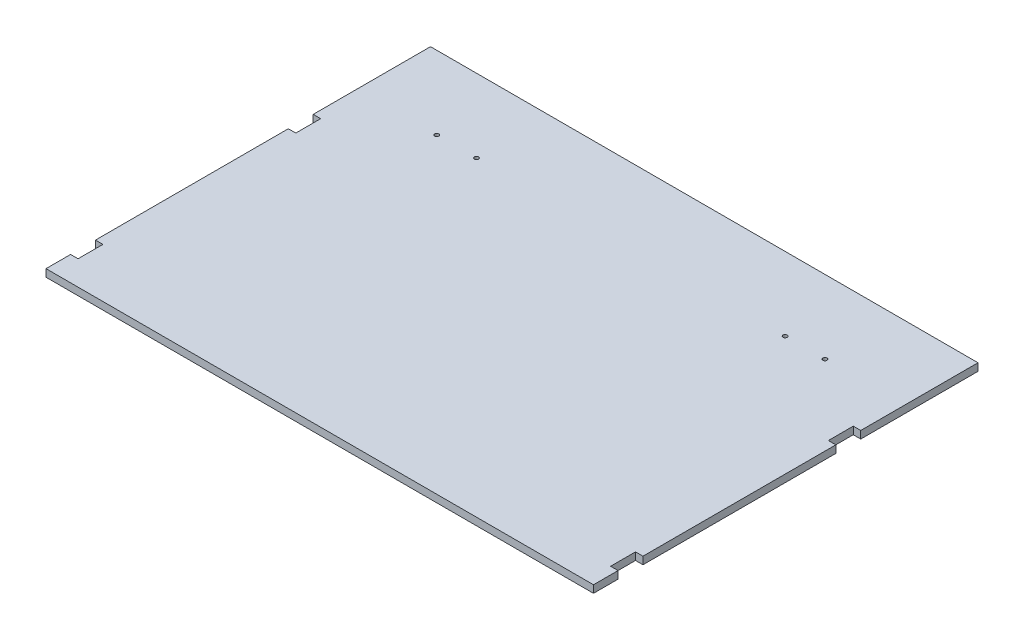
ISO-10303-21;
HEADER;
FILE_DESCRIPTION(('STEP AP214'),'2;1');
FILE_NAME('part.step','',(''),(''),'','','');
FILE_SCHEMA(('AUTOMOTIVE_DESIGN { 1 0 10303 214 1 1 1 1 }'));
ENDSEC;
DATA;
#1=APPLICATION_CONTEXT('core data for automotive mechanical design processes');
#2=APPLICATION_PROTOCOL_DEFINITION('international standard','automotive_design',2000,#1);
#3=PRODUCT_CONTEXT('',#1,'mechanical');
#4=PRODUCT('Part','Part','',(#3));
#5=PRODUCT_RELATED_PRODUCT_CATEGORY('part','',(#4));
#6=PRODUCT_DEFINITION_FORMATION('','',#4);
#7=PRODUCT_DEFINITION_CONTEXT('part definition',#1,'design');
#8=PRODUCT_DEFINITION('design','',#6,#7);
#9=PRODUCT_DEFINITION_SHAPE('','',#8);
#10=(LENGTH_UNIT() NAMED_UNIT(*) SI_UNIT(.MILLI.,.METRE.));
#11=(NAMED_UNIT(*) PLANE_ANGLE_UNIT() SI_UNIT($,.RADIAN.));
#12=(NAMED_UNIT(*) SI_UNIT($,.STERADIAN.) SOLID_ANGLE_UNIT());
#13=UNCERTAINTY_MEASURE_WITH_UNIT(LENGTH_MEASURE(1.E-05),#10,'distance_accuracy_value','');
#14=(GEOMETRIC_REPRESENTATION_CONTEXT(3) GLOBAL_UNCERTAINTY_ASSIGNED_CONTEXT((#13)) GLOBAL_UNIT_ASSIGNED_CONTEXT((#10,
#11,#12)) REPRESENTATION_CONTEXT('',''));
#15=CARTESIAN_POINT('',(0.,0.,0.));
#16=DIRECTION('',(0.,0.,1.));
#17=DIRECTION('',(1.,0.,0.));
#18=AXIS2_PLACEMENT_3D('',#15,#16,#17);
#19=CARTESIAN_POINT('',(0.,6.,0.));
#20=DIRECTION('',(0.,1.,0.));
#21=DIRECTION('',(0.,0.,1.));
#22=AXIS2_PLACEMENT_3D('',#19,#20,#21);
#23=PLANE('',#22);
#24=CARTESIAN_POINT('',(156.,6.,-95.5));
#25=DIRECTION('',(0.,1.,0.));
#26=DIRECTION('',(0.,0.,-1.));
#27=AXIS2_PLACEMENT_3D('',#24,#25,#26);
#28=CIRCLE('',#27,1.65000000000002);
#29=CARTESIAN_POINT('',(156.,6.,-97.15));
#30=VERTEX_POINT('',#29);
#31=EDGE_CURVE('E396',#30,#30,#28,.T.);
#32=ORIENTED_EDGE('',*,*,#31,.F.);
#33=EDGE_LOOP('',(#32));
#34=FACE_BOUND('',#33,.T.);
#35=CARTESIAN_POINT('',(-156.,6.,-95.5));
#36=DIRECTION('',(0.,1.,0.));
#37=DIRECTION('',(0.,0.,1.));
#38=AXIS2_PLACEMENT_3D('',#35,#36,#37);
#39=CIRCLE('',#38,1.65000000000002);
#40=CARTESIAN_POINT('',(-156.,6.,-93.85));
#41=VERTEX_POINT('',#40);
#42=EDGE_CURVE('E206',#41,#41,#39,.T.);
#43=ORIENTED_EDGE('',*,*,#42,.F.);
#44=EDGE_LOOP('',(#43));
#45=FACE_BOUND('',#44,.T.);
#46=DIRECTION('',(0.,0.,1.));
#47=VECTOR('',#46,1.);
#48=CARTESIAN_POINT('',(-220.,6.,-154.5));
#49=LINE('',#48,#47);
#50=CARTESIAN_POINT('',(-220.,6.,-154.5));
#51=VERTEX_POINT('',#50);
#52=CARTESIAN_POINT('',(-220.,6.,-60.25));
#53=VERTEX_POINT('',#52);
#54=EDGE_CURVE('E241',#51,#53,#49,.T.);
#55=ORIENTED_EDGE('',*,*,#54,.T.);
#56=DIRECTION('',(1.,0.,0.));
#57=VECTOR('',#56,1.);
#58=CARTESIAN_POINT('',(-220.,6.,-60.25));
#59=LINE('',#58,#57);
#60=CARTESIAN_POINT('',(-214.,6.,-60.25));
#61=VERTEX_POINT('',#60);
#62=EDGE_CURVE('E129',#53,#61,#59,.T.);
#63=ORIENTED_EDGE('',*,*,#62,.T.);
#64=DIRECTION('',(0.,0.,1.));
#65=VECTOR('',#64,1.);
#66=CARTESIAN_POINT('',(-214.,6.,-60.25));
#67=LINE('',#66,#65);
#68=CARTESIAN_POINT('',(-214.,6.,-40.25));
#69=VERTEX_POINT('',#68);
#70=EDGE_CURVE('E292',#61,#69,#67,.T.);
#71=ORIENTED_EDGE('',*,*,#70,.T.);
#72=DIRECTION('',(-1.,0.,0.));
#73=VECTOR('',#72,1.);
#74=CARTESIAN_POINT('',(-220.,6.,-40.25));
#75=LINE('',#74,#73);
#76=CARTESIAN_POINT('',(-220.,6.,-40.25));
#77=VERTEX_POINT('',#76);
#78=EDGE_CURVE('E311',#69,#77,#75,.T.);
#79=ORIENTED_EDGE('',*,*,#78,.T.);
#80=DIRECTION('',(0.,0.,1.));
#81=VECTOR('',#80,1.);
#82=CARTESIAN_POINT('',(-220.,6.,-40.25));
#83=LINE('',#82,#81);
#84=CARTESIAN_POINT('',(-220.,6.,114.75));
#85=VERTEX_POINT('',#84);
#86=EDGE_CURVE('E308',#77,#85,#83,.T.);
#87=ORIENTED_EDGE('',*,*,#86,.T.);
#88=DIRECTION('',(1.,0.,0.));
#89=VECTOR('',#88,1.);
#90=CARTESIAN_POINT('',(-220.,6.,114.75));
#91=LINE('',#90,#89);
#92=CARTESIAN_POINT('',(-214.,6.,114.75));
#93=VERTEX_POINT('',#92);
#94=EDGE_CURVE('E310',#85,#93,#91,.T.);
#95=ORIENTED_EDGE('',*,*,#94,.T.);
#96=DIRECTION('',(0.,0.,1.));
#97=VECTOR('',#96,1.);
#98=CARTESIAN_POINT('',(-214.,6.,114.75));
#99=LINE('',#98,#97);
#100=CARTESIAN_POINT('',(-214.,6.,134.75));
#101=VERTEX_POINT('',#100);
#102=EDGE_CURVE('E313',#93,#101,#99,.T.);
#103=ORIENTED_EDGE('',*,*,#102,.T.);
#104=DIRECTION('',(-1.,0.,0.));
#105=VECTOR('',#104,1.);
#106=CARTESIAN_POINT('',(-220.,6.,134.75));
#107=LINE('',#106,#105);
#108=CARTESIAN_POINT('',(-220.,6.,134.75));
#109=VERTEX_POINT('',#108);
#110=EDGE_CURVE('E319',#101,#109,#107,.T.);
#111=ORIENTED_EDGE('',*,*,#110,.T.);
#112=DIRECTION('',(0.,0.,1.));
#113=VECTOR('',#112,1.);
#114=CARTESIAN_POINT('',(-220.,6.,134.75));
#115=LINE('',#114,#113);
#116=CARTESIAN_POINT('',(-220.,6.,154.5));
#117=VERTEX_POINT('',#116);
#118=EDGE_CURVE('E321',#109,#117,#115,.T.);
#119=ORIENTED_EDGE('',*,*,#118,.T.);
#120=DIRECTION('',(1.,0.,0.));
#121=VECTOR('',#120,1.);
#122=CARTESIAN_POINT('',(-220.,6.,154.5));
#123=LINE('',#122,#121);
#124=CARTESIAN_POINT('',(220.,6.,154.5));
#125=VERTEX_POINT('',#124);
#126=EDGE_CURVE('E323',#117,#125,#123,.T.);
#127=ORIENTED_EDGE('',*,*,#126,.T.);
#128=DIRECTION('',(0.,0.,-1.));
#129=VECTOR('',#128,1.);
#130=CARTESIAN_POINT('',(220.,6.,134.75));
#131=LINE('',#130,#129);
#132=CARTESIAN_POINT('',(220.,6.,134.75));
#133=VERTEX_POINT('',#132);
#134=EDGE_CURVE('E325',#125,#133,#131,.T.);
#135=ORIENTED_EDGE('',*,*,#134,.T.);
#136=DIRECTION('',(-1.,0.,0.));
#137=VECTOR('',#136,1.);
#138=CARTESIAN_POINT('',(220.,6.,134.75));
#139=LINE('',#138,#137);
#140=CARTESIAN_POINT('',(214.,6.,134.75));
#141=VERTEX_POINT('',#140);
#142=EDGE_CURVE('E327',#133,#141,#139,.T.);
#143=ORIENTED_EDGE('',*,*,#142,.T.);
#144=DIRECTION('',(0.,0.,-1.));
#145=VECTOR('',#144,1.);
#146=CARTESIAN_POINT('',(214.,6.,114.75));
#147=LINE('',#146,#145);
#148=CARTESIAN_POINT('',(214.,6.,114.75));
#149=VERTEX_POINT('',#148);
#150=EDGE_CURVE('E329',#141,#149,#147,.T.);
#151=ORIENTED_EDGE('',*,*,#150,.T.);
#152=DIRECTION('',(1.,0.,0.));
#153=VECTOR('',#152,1.);
#154=CARTESIAN_POINT('',(220.,6.,114.75));
#155=LINE('',#154,#153);
#156=CARTESIAN_POINT('',(220.,6.,114.75));
#157=VERTEX_POINT('',#156);
#158=EDGE_CURVE('E331',#149,#157,#155,.T.);
#159=ORIENTED_EDGE('',*,*,#158,.T.);
#160=DIRECTION('',(0.,0.,-1.));
#161=VECTOR('',#160,1.);
#162=CARTESIAN_POINT('',(220.,6.,-40.25));
#163=LINE('',#162,#161);
#164=CARTESIAN_POINT('',(220.,6.,-40.25));
#165=VERTEX_POINT('',#164);
#166=EDGE_CURVE('E333',#157,#165,#163,.T.);
#167=ORIENTED_EDGE('',*,*,#166,.T.);
#168=DIRECTION('',(-1.,0.,0.));
#169=VECTOR('',#168,1.);
#170=CARTESIAN_POINT('',(220.,6.,-40.25));
#171=LINE('',#170,#169);
#172=CARTESIAN_POINT('',(214.,6.,-40.25));
#173=VERTEX_POINT('',#172);
#174=EDGE_CURVE('E335',#165,#173,#171,.T.);
#175=ORIENTED_EDGE('',*,*,#174,.T.);
#176=DIRECTION('',(0.,0.,-1.));
#177=VECTOR('',#176,1.);
#178=CARTESIAN_POINT('',(214.,6.,-60.25));
#179=LINE('',#178,#177);
#180=CARTESIAN_POINT('',(214.,6.,-60.25));
#181=VERTEX_POINT('',#180);
#182=EDGE_CURVE('E184',#173,#181,#179,.T.);
#183=ORIENTED_EDGE('',*,*,#182,.T.);
#184=DIRECTION('',(1.,0.,0.));
#185=VECTOR('',#184,1.);
#186=CARTESIAN_POINT('',(220.,6.,-60.25));
#187=LINE('',#186,#185);
#188=CARTESIAN_POINT('',(220.,6.,-60.25));
#189=VERTEX_POINT('',#188);
#190=EDGE_CURVE('E178',#181,#189,#187,.T.);
#191=ORIENTED_EDGE('',*,*,#190,.T.);
#192=DIRECTION('',(0.,0.,-1.));
#193=VECTOR('',#192,1.);
#194=CARTESIAN_POINT('',(220.,6.,-154.5));
#195=LINE('',#194,#193);
#196=CARTESIAN_POINT('',(220.,6.,-154.5));
#197=VERTEX_POINT('',#196);
#198=EDGE_CURVE('E182',#189,#197,#195,.T.);
#199=ORIENTED_EDGE('',*,*,#198,.T.);
#200=DIRECTION('',(-1.,0.,0.));
#201=VECTOR('',#200,1.);
#202=CARTESIAN_POINT('',(-220.,6.,-154.5));
#203=LINE('',#202,#201);
#204=EDGE_CURVE('E50',#197,#51,#203,.T.);
#205=ORIENTED_EDGE('',*,*,#204,.T.);
#206=EDGE_LOOP('',(#55,#63,#71,#79,#87,#95,#103,#111,#119,#127,#135,#143,#151,#159,#167,#175,
#183,#191,#199,#205));
#207=FACE_BOUND('',#206,.T.);
#208=CARTESIAN_POINT('',(-124.,6.,-95.5));
#209=DIRECTION('',(0.,1.,0.));
#210=DIRECTION('',(0.,0.,-1.));
#211=AXIS2_PLACEMENT_3D('',#208,#209,#210);
#212=CIRCLE('',#211,1.65000000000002);
#213=CARTESIAN_POINT('',(-124.,6.,-97.15));
#214=VERTEX_POINT('',#213);
#215=EDGE_CURVE('E402',#214,#214,#212,.T.);
#216=ORIENTED_EDGE('',*,*,#215,.F.);
#217=EDGE_LOOP('',(#216));
#218=FACE_BOUND('',#217,.T.);
#219=CARTESIAN_POINT('',(124.,6.,-95.5));
#220=DIRECTION('',(0.,1.,0.));
#221=DIRECTION('',(0.,0.,1.));
#222=AXIS2_PLACEMENT_3D('',#219,#220,#221);
#223=CIRCLE('',#222,1.65000000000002);
#224=CARTESIAN_POINT('',(124.,6.,-93.85));
#225=VERTEX_POINT('',#224);
#226=EDGE_CURVE('E387',#225,#225,#223,.T.);
#227=ORIENTED_EDGE('',*,*,#226,.F.);
#228=EDGE_LOOP('',(#227));
#229=FACE_BOUND('',#228,.T.);
#230=ADVANCED_FACE('F33',(#34,#45,#207,#218,#229),#23,.T.);
#231=CARTESIAN_POINT('',(0.,0.,0.));
#232=DIRECTION('',(0.,1.,0.));
#233=DIRECTION('',(0.,0.,1.));
#234=AXIS2_PLACEMENT_3D('',#231,#232,#233);
#235=PLANE('',#234);
#236=CARTESIAN_POINT('',(156.,0.,-95.5));
#237=DIRECTION('',(0.,1.,0.));
#238=DIRECTION('',(0.,0.,-1.));
#239=AXIS2_PLACEMENT_3D('',#236,#237,#238);
#240=CIRCLE('',#239,1.65000000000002);
#241=CARTESIAN_POINT('',(156.,0.,-97.15));
#242=VERTEX_POINT('',#241);
#243=EDGE_CURVE('E393',#242,#242,#240,.T.);
#244=ORIENTED_EDGE('',*,*,#243,.T.);
#245=EDGE_LOOP('',(#244));
#246=FACE_BOUND('',#245,.T.);
#247=CARTESIAN_POINT('',(-156.,0.,-95.5));
#248=DIRECTION('',(0.,1.,0.));
#249=DIRECTION('',(0.,0.,1.));
#250=AXIS2_PLACEMENT_3D('',#247,#248,#249);
#251=CIRCLE('',#250,1.65000000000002);
#252=CARTESIAN_POINT('',(-156.,0.,-93.85));
#253=VERTEX_POINT('',#252);
#254=EDGE_CURVE('E405',#253,#253,#251,.T.);
#255=ORIENTED_EDGE('',*,*,#254,.T.);
#256=EDGE_LOOP('',(#255));
#257=FACE_BOUND('',#256,.T.);
#258=DIRECTION('',(0.,0.,1.));
#259=VECTOR('',#258,1.);
#260=CARTESIAN_POINT('',(-220.,0.,-154.5));
#261=LINE('',#260,#259);
#262=CARTESIAN_POINT('',(-220.,0.,-154.5));
#263=VERTEX_POINT('',#262);
#264=CARTESIAN_POINT('',(-220.,0.,-60.25));
#265=VERTEX_POINT('',#264);
#266=EDGE_CURVE('E202',#263,#265,#261,.T.);
#267=ORIENTED_EDGE('',*,*,#266,.F.);
#268=DIRECTION('',(-1.,0.,0.));
#269=VECTOR('',#268,1.);
#270=CARTESIAN_POINT('',(-220.,0.,-154.5));
#271=LINE('',#270,#269);
#272=CARTESIAN_POINT('',(220.,0.,-154.5));
#273=VERTEX_POINT('',#272);
#274=EDGE_CURVE('E121',#273,#263,#271,.T.);
#275=ORIENTED_EDGE('',*,*,#274,.F.);
#276=DIRECTION('',(0.,0.,-1.));
#277=VECTOR('',#276,1.);
#278=CARTESIAN_POINT('',(220.,0.,-154.5));
#279=LINE('',#278,#277);
#280=CARTESIAN_POINT('',(220.,0.,-60.25));
#281=VERTEX_POINT('',#280);
#282=EDGE_CURVE('E115',#281,#273,#279,.T.);
#283=ORIENTED_EDGE('',*,*,#282,.F.);
#284=DIRECTION('',(1.,0.,0.));
#285=VECTOR('',#284,1.);
#286=CARTESIAN_POINT('',(220.,0.,-60.25));
#287=LINE('',#286,#285);
#288=CARTESIAN_POINT('',(214.,0.,-60.25));
#289=VERTEX_POINT('',#288);
#290=EDGE_CURVE('E192',#289,#281,#287,.T.);
#291=ORIENTED_EDGE('',*,*,#290,.F.);
#292=DIRECTION('',(0.,0.,-1.));
#293=VECTOR('',#292,1.);
#294=CARTESIAN_POINT('',(214.,0.,-60.25));
#295=LINE('',#294,#293);
#296=CARTESIAN_POINT('',(214.,0.,-40.25));
#297=VERTEX_POINT('',#296);
#298=EDGE_CURVE('E236',#297,#289,#295,.T.);
#299=ORIENTED_EDGE('',*,*,#298,.F.);
#300=DIRECTION('',(-1.,0.,0.));
#301=VECTOR('',#300,1.);
#302=CARTESIAN_POINT('',(220.,0.,-40.25));
#303=LINE('',#302,#301);
#304=CARTESIAN_POINT('',(220.,0.,-40.25));
#305=VERTEX_POINT('',#304);
#306=EDGE_CURVE('E234',#305,#297,#303,.T.);
#307=ORIENTED_EDGE('',*,*,#306,.F.);
#308=DIRECTION('',(0.,0.,-1.));
#309=VECTOR('',#308,1.);
#310=CARTESIAN_POINT('',(220.,0.,-40.25));
#311=LINE('',#310,#309);
#312=CARTESIAN_POINT('',(220.,0.,114.75));
#313=VERTEX_POINT('',#312);
#314=EDGE_CURVE('E232',#313,#305,#311,.T.);
#315=ORIENTED_EDGE('',*,*,#314,.F.);
#316=DIRECTION('',(1.,0.,0.));
#317=VECTOR('',#316,1.);
#318=CARTESIAN_POINT('',(220.,0.,114.75));
#319=LINE('',#318,#317);
#320=CARTESIAN_POINT('',(214.,0.,114.75));
#321=VERTEX_POINT('',#320);
#322=EDGE_CURVE('E230',#321,#313,#319,.T.);
#323=ORIENTED_EDGE('',*,*,#322,.F.);
#324=DIRECTION('',(0.,0.,-1.));
#325=VECTOR('',#324,1.);
#326=CARTESIAN_POINT('',(214.,0.,114.75));
#327=LINE('',#326,#325);
#328=CARTESIAN_POINT('',(214.,0.,134.75));
#329=VERTEX_POINT('',#328);
#330=EDGE_CURVE('E228',#329,#321,#327,.T.);
#331=ORIENTED_EDGE('',*,*,#330,.F.);
#332=DIRECTION('',(-1.,0.,0.));
#333=VECTOR('',#332,1.);
#334=CARTESIAN_POINT('',(220.,0.,134.75));
#335=LINE('',#334,#333);
#336=CARTESIAN_POINT('',(220.,0.,134.75));
#337=VERTEX_POINT('',#336);
#338=EDGE_CURVE('E226',#337,#329,#335,.T.);
#339=ORIENTED_EDGE('',*,*,#338,.F.);
#340=DIRECTION('',(0.,0.,-1.));
#341=VECTOR('',#340,1.);
#342=CARTESIAN_POINT('',(220.,0.,134.75));
#343=LINE('',#342,#341);
#344=CARTESIAN_POINT('',(220.,0.,154.5));
#345=VERTEX_POINT('',#344);
#346=EDGE_CURVE('E224',#345,#337,#343,.T.);
#347=ORIENTED_EDGE('',*,*,#346,.F.);
#348=DIRECTION('',(1.,0.,0.));
#349=VECTOR('',#348,1.);
#350=CARTESIAN_POINT('',(-220.,0.,154.5));
#351=LINE('',#350,#349);
#352=CARTESIAN_POINT('',(-220.,0.,154.5));
#353=VERTEX_POINT('',#352);
#354=EDGE_CURVE('E222',#353,#345,#351,.T.);
#355=ORIENTED_EDGE('',*,*,#354,.F.);
#356=DIRECTION('',(0.,0.,1.));
#357=VECTOR('',#356,1.);
#358=CARTESIAN_POINT('',(-220.,0.,134.75));
#359=LINE('',#358,#357);
#360=CARTESIAN_POINT('',(-220.,0.,134.75));
#361=VERTEX_POINT('',#360);
#362=EDGE_CURVE('E220',#361,#353,#359,.T.);
#363=ORIENTED_EDGE('',*,*,#362,.F.);
#364=DIRECTION('',(-1.,0.,0.));
#365=VECTOR('',#364,1.);
#366=CARTESIAN_POINT('',(-220.,0.,134.75));
#367=LINE('',#366,#365);
#368=CARTESIAN_POINT('',(-214.,0.,134.75));
#369=VERTEX_POINT('',#368);
#370=EDGE_CURVE('E218',#369,#361,#367,.T.);
#371=ORIENTED_EDGE('',*,*,#370,.F.);
#372=DIRECTION('',(0.,0.,1.));
#373=VECTOR('',#372,1.);
#374=CARTESIAN_POINT('',(-214.,0.,114.75));
#375=LINE('',#374,#373);
#376=CARTESIAN_POINT('',(-214.,0.,114.75));
#377=VERTEX_POINT('',#376);
#378=EDGE_CURVE('E216',#377,#369,#375,.T.);
#379=ORIENTED_EDGE('',*,*,#378,.F.);
#380=DIRECTION('',(1.,0.,0.));
#381=VECTOR('',#380,1.);
#382=CARTESIAN_POINT('',(-220.,0.,114.75));
#383=LINE('',#382,#381);
#384=CARTESIAN_POINT('',(-220.,0.,114.75));
#385=VERTEX_POINT('',#384);
#386=EDGE_CURVE('E214',#385,#377,#383,.T.);
#387=ORIENTED_EDGE('',*,*,#386,.F.);
#388=DIRECTION('',(0.,0.,1.));
#389=VECTOR('',#388,1.);
#390=CARTESIAN_POINT('',(-220.,0.,-40.25));
#391=LINE('',#390,#389);
#392=CARTESIAN_POINT('',(-220.,0.,-40.25));
#393=VERTEX_POINT('',#392);
#394=EDGE_CURVE('E212',#393,#385,#391,.T.);
#395=ORIENTED_EDGE('',*,*,#394,.F.);
#396=DIRECTION('',(-1.,0.,0.));
#397=VECTOR('',#396,1.);
#398=CARTESIAN_POINT('',(-220.,0.,-40.25));
#399=LINE('',#398,#397);
#400=CARTESIAN_POINT('',(-214.,0.,-40.25));
#401=VERTEX_POINT('',#400);
#402=EDGE_CURVE('E210',#401,#393,#399,.T.);
#403=ORIENTED_EDGE('',*,*,#402,.F.);
#404=DIRECTION('',(0.,0.,1.));
#405=VECTOR('',#404,1.);
#406=CARTESIAN_POINT('',(-214.,0.,-60.25));
#407=LINE('',#406,#405);
#408=CARTESIAN_POINT('',(-214.,0.,-60.25));
#409=VERTEX_POINT('',#408);
#410=EDGE_CURVE('E208',#409,#401,#407,.T.);
#411=ORIENTED_EDGE('',*,*,#410,.F.);
#412=DIRECTION('',(1.,0.,0.));
#413=VECTOR('',#412,1.);
#414=CARTESIAN_POINT('',(-220.,0.,-60.25));
#415=LINE('',#414,#413);
#416=EDGE_CURVE('E205',#265,#409,#415,.T.);
#417=ORIENTED_EDGE('',*,*,#416,.F.);
#418=EDGE_LOOP('',(#267,#275,#283,#291,#299,#307,#315,#323,#331,#339,#347,#355,#363,#371,#379,
#387,#395,#403,#411,#417));
#419=FACE_BOUND('',#418,.T.);
#420=CARTESIAN_POINT('',(-124.,0.,-95.5));
#421=DIRECTION('',(0.,1.,0.));
#422=DIRECTION('',(0.,0.,-1.));
#423=AXIS2_PLACEMENT_3D('',#420,#421,#422);
#424=CIRCLE('',#423,1.65000000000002);
#425=CARTESIAN_POINT('',(-124.,0.,-97.15));
#426=VERTEX_POINT('',#425);
#427=EDGE_CURVE('E399',#426,#426,#424,.T.);
#428=ORIENTED_EDGE('',*,*,#427,.T.);
#429=EDGE_LOOP('',(#428));
#430=FACE_BOUND('',#429,.T.);
#431=CARTESIAN_POINT('',(124.,0.,-95.5));
#432=DIRECTION('',(0.,1.,0.));
#433=DIRECTION('',(0.,0.,1.));
#434=AXIS2_PLACEMENT_3D('',#431,#432,#433);
#435=CIRCLE('',#434,1.65000000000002);
#436=CARTESIAN_POINT('',(124.,0.,-93.85));
#437=VERTEX_POINT('',#436);
#438=EDGE_CURVE('E390',#437,#437,#435,.T.);
#439=ORIENTED_EDGE('',*,*,#438,.T.);
#440=EDGE_LOOP('',(#439));
#441=FACE_BOUND('',#440,.T.);
#442=ADVANCED_FACE('F296',(#246,#257,#419,#430,#441),#235,.F.);
#443=CARTESIAN_POINT('',(-220.,6.,-154.5));
#444=DIRECTION('',(1.,0.,0.));
#445=DIRECTION('',(0.,0.,-1.));
#446=AXIS2_PLACEMENT_3D('',#443,#444,#445);
#447=PLANE('',#446);
#448=ORIENTED_EDGE('',*,*,#266,.T.);
#449=DIRECTION('',(0.,-1.,0.));
#450=VECTOR('',#449,1.);
#451=CARTESIAN_POINT('',(-220.,6.,-60.25));
#452=LINE('',#451,#450);
#453=EDGE_CURVE('E11',#53,#265,#452,.T.);
#454=ORIENTED_EDGE('',*,*,#453,.F.);
#455=ORIENTED_EDGE('',*,*,#54,.F.);
#456=DIRECTION('',(0.,-1.,0.));
#457=VECTOR('',#456,1.);
#458=CARTESIAN_POINT('',(-220.,6.,-154.5));
#459=LINE('',#458,#457);
#460=EDGE_CURVE('E198',#51,#263,#459,.T.);
#461=ORIENTED_EDGE('',*,*,#460,.T.);
#462=EDGE_LOOP('',(#448,#454,#455,#461));
#463=FACE_BOUND('',#462,.T.);
#464=ADVANCED_FACE('F35',(#463),#447,.F.);
#465=CARTESIAN_POINT('',(-220.,6.,-60.25));
#466=DIRECTION('',(0.,0.,-1.));
#467=DIRECTION('',(-1.,0.,0.));
#468=AXIS2_PLACEMENT_3D('',#465,#466,#467);
#469=PLANE('',#468);
#470=ORIENTED_EDGE('',*,*,#416,.T.);
#471=DIRECTION('',(0.,-1.,0.));
#472=VECTOR('',#471,1.);
#473=CARTESIAN_POINT('',(-214.,6.,-60.25));
#474=LINE('',#473,#472);
#475=EDGE_CURVE('E42',#61,#409,#474,.T.);
#476=ORIENTED_EDGE('',*,*,#475,.F.);
#477=ORIENTED_EDGE('',*,*,#62,.F.);
#478=ORIENTED_EDGE('',*,*,#453,.T.);
#479=EDGE_LOOP('',(#470,#476,#477,#478));
#480=FACE_BOUND('',#479,.T.);
#481=ADVANCED_FACE('F594',(#480),#469,.F.);
#482=CARTESIAN_POINT('',(-214.,6.,-60.25));
#483=DIRECTION('',(1.,0.,0.));
#484=DIRECTION('',(0.,0.,-1.));
#485=AXIS2_PLACEMENT_3D('',#482,#483,#484);
#486=PLANE('',#485);
#487=ORIENTED_EDGE('',*,*,#410,.T.);
#488=DIRECTION('',(0.,-1.,0.));
#489=VECTOR('',#488,1.);
#490=CARTESIAN_POINT('',(-214.,6.,-40.25));
#491=LINE('',#490,#489);
#492=EDGE_CURVE('E284',#69,#401,#491,.T.);
#493=ORIENTED_EDGE('',*,*,#492,.F.);
#494=ORIENTED_EDGE('',*,*,#70,.F.);
#495=ORIENTED_EDGE('',*,*,#475,.T.);
#496=EDGE_LOOP('',(#487,#493,#494,#495));
#497=FACE_BOUND('',#496,.T.);
#498=ADVANCED_FACE('F290',(#497),#486,.F.);
#499=CARTESIAN_POINT('',(-220.,6.,-40.25));
#500=DIRECTION('',(0.,0.,1.));
#501=DIRECTION('',(1.,0.,0.));
#502=AXIS2_PLACEMENT_3D('',#499,#500,#501);
#503=PLANE('',#502);
#504=ORIENTED_EDGE('',*,*,#402,.T.);
#505=DIRECTION('',(0.,-1.,0.));
#506=VECTOR('',#505,1.);
#507=CARTESIAN_POINT('',(-220.,6.,-40.25));
#508=LINE('',#507,#506);
#509=EDGE_CURVE('E281',#77,#393,#508,.T.);
#510=ORIENTED_EDGE('',*,*,#509,.F.);
#511=ORIENTED_EDGE('',*,*,#78,.F.);
#512=ORIENTED_EDGE('',*,*,#492,.T.);
#513=EDGE_LOOP('',(#504,#510,#511,#512));
#514=FACE_BOUND('',#513,.T.);
#515=ADVANCED_FACE('F302',(#514),#503,.F.);
#516=CARTESIAN_POINT('',(-220.,6.,-40.25));
#517=DIRECTION('',(1.,0.,0.));
#518=DIRECTION('',(0.,0.,-1.));
#519=AXIS2_PLACEMENT_3D('',#516,#517,#518);
#520=PLANE('',#519);
#521=ORIENTED_EDGE('',*,*,#394,.T.);
#522=DIRECTION('',(0.,-1.,0.));
#523=VECTOR('',#522,1.);
#524=CARTESIAN_POINT('',(-220.,6.,114.75));
#525=LINE('',#524,#523);
#526=EDGE_CURVE('E278',#85,#385,#525,.T.);
#527=ORIENTED_EDGE('',*,*,#526,.F.);
#528=ORIENTED_EDGE('',*,*,#86,.F.);
#529=ORIENTED_EDGE('',*,*,#509,.T.);
#530=EDGE_LOOP('',(#521,#527,#528,#529));
#531=FACE_BOUND('',#530,.T.);
#532=ADVANCED_FACE('F306',(#531),#520,.F.);
#533=CARTESIAN_POINT('',(-220.,6.,114.75));
#534=DIRECTION('',(0.,0.,-1.));
#535=DIRECTION('',(-1.,0.,0.));
#536=AXIS2_PLACEMENT_3D('',#533,#534,#535);
#537=PLANE('',#536);
#538=ORIENTED_EDGE('',*,*,#386,.T.);
#539=DIRECTION('',(0.,-1.,0.));
#540=VECTOR('',#539,1.);
#541=CARTESIAN_POINT('',(-214.,6.,114.75));
#542=LINE('',#541,#540);
#543=EDGE_CURVE('E275',#93,#377,#542,.T.);
#544=ORIENTED_EDGE('',*,*,#543,.F.);
#545=ORIENTED_EDGE('',*,*,#94,.F.);
#546=ORIENTED_EDGE('',*,*,#526,.T.);
#547=EDGE_LOOP('',(#538,#544,#545,#546));
#548=FACE_BOUND('',#547,.T.);
#549=ADVANCED_FACE('F559',(#548),#537,.F.);
#550=CARTESIAN_POINT('',(-214.,6.,114.75));
#551=DIRECTION('',(1.,0.,0.));
#552=DIRECTION('',(0.,0.,-1.));
#553=AXIS2_PLACEMENT_3D('',#550,#551,#552);
#554=PLANE('',#553);
#555=ORIENTED_EDGE('',*,*,#378,.T.);
#556=DIRECTION('',(0.,-1.,0.));
#557=VECTOR('',#556,1.);
#558=CARTESIAN_POINT('',(-214.,6.,134.75));
#559=LINE('',#558,#557);
#560=EDGE_CURVE('E272',#101,#369,#559,.T.);
#561=ORIENTED_EDGE('',*,*,#560,.F.);
#562=ORIENTED_EDGE('',*,*,#102,.F.);
#563=ORIENTED_EDGE('',*,*,#543,.T.);
#564=EDGE_LOOP('',(#555,#561,#562,#563));
#565=FACE_BOUND('',#564,.T.);
#566=ADVANCED_FACE('F549',(#565),#554,.F.);
#567=CARTESIAN_POINT('',(-220.,6.,134.75));
#568=DIRECTION('',(0.,0.,1.));
#569=DIRECTION('',(1.,0.,0.));
#570=AXIS2_PLACEMENT_3D('',#567,#568,#569);
#571=PLANE('',#570);
#572=ORIENTED_EDGE('',*,*,#370,.T.);
#573=DIRECTION('',(0.,-1.,0.));
#574=VECTOR('',#573,1.);
#575=CARTESIAN_POINT('',(-220.,6.,134.75));
#576=LINE('',#575,#574);
#577=EDGE_CURVE('E269',#109,#361,#576,.T.);
#578=ORIENTED_EDGE('',*,*,#577,.F.);
#579=ORIENTED_EDGE('',*,*,#110,.F.);
#580=ORIENTED_EDGE('',*,*,#560,.T.);
#581=EDGE_LOOP('',(#572,#578,#579,#580));
#582=FACE_BOUND('',#581,.T.);
#583=ADVANCED_FACE('F539',(#582),#571,.F.);
#584=CARTESIAN_POINT('',(-220.,6.,134.75));
#585=DIRECTION('',(1.,0.,0.));
#586=DIRECTION('',(0.,0.,-1.));
#587=AXIS2_PLACEMENT_3D('',#584,#585,#586);
#588=PLANE('',#587);
#589=ORIENTED_EDGE('',*,*,#362,.T.);
#590=DIRECTION('',(0.,-1.,0.));
#591=VECTOR('',#590,1.);
#592=CARTESIAN_POINT('',(-220.,6.,154.5));
#593=LINE('',#592,#591);
#594=EDGE_CURVE('E266',#117,#353,#593,.T.);
#595=ORIENTED_EDGE('',*,*,#594,.F.);
#596=ORIENTED_EDGE('',*,*,#118,.F.);
#597=ORIENTED_EDGE('',*,*,#577,.T.);
#598=EDGE_LOOP('',(#589,#595,#596,#597));
#599=FACE_BOUND('',#598,.T.);
#600=ADVANCED_FACE('F529',(#599),#588,.F.);
#601=CARTESIAN_POINT('',(-220.,6.,154.5));
#602=DIRECTION('',(0.,0.,-1.));
#603=DIRECTION('',(-1.,0.,0.));
#604=AXIS2_PLACEMENT_3D('',#601,#602,#603);
#605=PLANE('',#604);
#606=ORIENTED_EDGE('',*,*,#354,.T.);
#607=DIRECTION('',(0.,-1.,0.));
#608=VECTOR('',#607,1.);
#609=CARTESIAN_POINT('',(220.,6.,154.5));
#610=LINE('',#609,#608);
#611=EDGE_CURVE('E263',#125,#345,#610,.T.);
#612=ORIENTED_EDGE('',*,*,#611,.F.);
#613=ORIENTED_EDGE('',*,*,#126,.F.);
#614=ORIENTED_EDGE('',*,*,#594,.T.);
#615=EDGE_LOOP('',(#606,#612,#613,#614));
#616=FACE_BOUND('',#615,.T.);
#617=ADVANCED_FACE('F519',(#616),#605,.F.);
#618=CARTESIAN_POINT('',(220.,6.,134.75));
#619=DIRECTION('',(-1.,0.,0.));
#620=DIRECTION('',(0.,0.,1.));
#621=AXIS2_PLACEMENT_3D('',#618,#619,#620);
#622=PLANE('',#621);
#623=ORIENTED_EDGE('',*,*,#346,.T.);
#624=DIRECTION('',(0.,-1.,0.));
#625=VECTOR('',#624,1.);
#626=CARTESIAN_POINT('',(220.,6.,134.75));
#627=LINE('',#626,#625);
#628=EDGE_CURVE('E260',#133,#337,#627,.T.);
#629=ORIENTED_EDGE('',*,*,#628,.F.);
#630=ORIENTED_EDGE('',*,*,#134,.F.);
#631=ORIENTED_EDGE('',*,*,#611,.T.);
#632=EDGE_LOOP('',(#623,#629,#630,#631));
#633=FACE_BOUND('',#632,.T.);
#634=ADVANCED_FACE('F509',(#633),#622,.F.);
#635=CARTESIAN_POINT('',(220.,6.,134.75));
#636=DIRECTION('',(0.,0.,1.));
#637=DIRECTION('',(1.,0.,0.));
#638=AXIS2_PLACEMENT_3D('',#635,#636,#637);
#639=PLANE('',#638);
#640=ORIENTED_EDGE('',*,*,#338,.T.);
#641=DIRECTION('',(0.,-1.,0.));
#642=VECTOR('',#641,1.);
#643=CARTESIAN_POINT('',(214.,6.,134.75));
#644=LINE('',#643,#642);
#645=EDGE_CURVE('E257',#141,#329,#644,.T.);
#646=ORIENTED_EDGE('',*,*,#645,.F.);
#647=ORIENTED_EDGE('',*,*,#142,.F.);
#648=ORIENTED_EDGE('',*,*,#628,.T.);
#649=EDGE_LOOP('',(#640,#646,#647,#648));
#650=FACE_BOUND('',#649,.T.);
#651=ADVANCED_FACE('F499',(#650),#639,.F.);
#652=CARTESIAN_POINT('',(214.,6.,114.75));
#653=DIRECTION('',(-1.,0.,0.));
#654=DIRECTION('',(0.,0.,1.));
#655=AXIS2_PLACEMENT_3D('',#652,#653,#654);
#656=PLANE('',#655);
#657=ORIENTED_EDGE('',*,*,#330,.T.);
#658=DIRECTION('',(0.,-1.,0.));
#659=VECTOR('',#658,1.);
#660=CARTESIAN_POINT('',(214.,6.,114.75));
#661=LINE('',#660,#659);
#662=EDGE_CURVE('E254',#149,#321,#661,.T.);
#663=ORIENTED_EDGE('',*,*,#662,.F.);
#664=ORIENTED_EDGE('',*,*,#150,.F.);
#665=ORIENTED_EDGE('',*,*,#645,.T.);
#666=EDGE_LOOP('',(#657,#663,#664,#665));
#667=FACE_BOUND('',#666,.T.);
#668=ADVANCED_FACE('F489',(#667),#656,.F.);
#669=CARTESIAN_POINT('',(220.,6.,114.75));
#670=DIRECTION('',(0.,0.,-1.));
#671=DIRECTION('',(-1.,0.,0.));
#672=AXIS2_PLACEMENT_3D('',#669,#670,#671);
#673=PLANE('',#672);
#674=ORIENTED_EDGE('',*,*,#322,.T.);
#675=DIRECTION('',(0.,-1.,0.));
#676=VECTOR('',#675,1.);
#677=CARTESIAN_POINT('',(220.,6.,114.75));
#678=LINE('',#677,#676);
#679=EDGE_CURVE('E251',#157,#313,#678,.T.);
#680=ORIENTED_EDGE('',*,*,#679,.F.);
#681=ORIENTED_EDGE('',*,*,#158,.F.);
#682=ORIENTED_EDGE('',*,*,#662,.T.);
#683=EDGE_LOOP('',(#674,#680,#681,#682));
#684=FACE_BOUND('',#683,.T.);
#685=ADVANCED_FACE('F479',(#684),#673,.F.);
#686=CARTESIAN_POINT('',(220.,6.,-40.25));
#687=DIRECTION('',(-1.,0.,0.));
#688=DIRECTION('',(0.,0.,1.));
#689=AXIS2_PLACEMENT_3D('',#686,#687,#688);
#690=PLANE('',#689);
#691=ORIENTED_EDGE('',*,*,#314,.T.);
#692=DIRECTION('',(0.,-1.,0.));
#693=VECTOR('',#692,1.);
#694=CARTESIAN_POINT('',(220.,6.,-40.25));
#695=LINE('',#694,#693);
#696=EDGE_CURVE('E248',#165,#305,#695,.T.);
#697=ORIENTED_EDGE('',*,*,#696,.F.);
#698=ORIENTED_EDGE('',*,*,#166,.F.);
#699=ORIENTED_EDGE('',*,*,#679,.T.);
#700=EDGE_LOOP('',(#691,#697,#698,#699));
#701=FACE_BOUND('',#700,.T.);
#702=ADVANCED_FACE('F470',(#701),#690,.F.);
#703=CARTESIAN_POINT('',(220.,6.,-40.25));
#704=DIRECTION('',(0.,0.,1.));
#705=DIRECTION('',(1.,0.,0.));
#706=AXIS2_PLACEMENT_3D('',#703,#704,#705);
#707=PLANE('',#706);
#708=ORIENTED_EDGE('',*,*,#306,.T.);
#709=DIRECTION('',(0.,-1.,0.));
#710=VECTOR('',#709,1.);
#711=CARTESIAN_POINT('',(214.,6.,-40.25));
#712=LINE('',#711,#710);
#713=EDGE_CURVE('E245',#173,#297,#712,.T.);
#714=ORIENTED_EDGE('',*,*,#713,.F.);
#715=ORIENTED_EDGE('',*,*,#174,.F.);
#716=ORIENTED_EDGE('',*,*,#696,.T.);
#717=EDGE_LOOP('',(#708,#714,#715,#716));
#718=FACE_BOUND('',#717,.T.);
#719=ADVANCED_FACE('F341',(#718),#707,.F.);
#720=CARTESIAN_POINT('',(214.,6.,-60.25));
#721=DIRECTION('',(-1.,0.,0.));
#722=DIRECTION('',(0.,0.,1.));
#723=AXIS2_PLACEMENT_3D('',#720,#721,#722);
#724=PLANE('',#723);
#725=ORIENTED_EDGE('',*,*,#298,.T.);
#726=DIRECTION('',(0.,-1.,0.));
#727=VECTOR('',#726,1.);
#728=CARTESIAN_POINT('',(214.,6.,-60.25));
#729=LINE('',#728,#727);
#730=EDGE_CURVE('E193',#181,#289,#729,.T.);
#731=ORIENTED_EDGE('',*,*,#730,.F.);
#732=ORIENTED_EDGE('',*,*,#182,.F.);
#733=ORIENTED_EDGE('',*,*,#713,.T.);
#734=EDGE_LOOP('',(#725,#731,#732,#733));
#735=FACE_BOUND('',#734,.T.);
#736=ADVANCED_FACE('F345',(#735),#724,.F.);
#737=CARTESIAN_POINT('',(220.,6.,-60.25));
#738=DIRECTION('',(0.,0.,-1.));
#739=DIRECTION('',(-1.,0.,0.));
#740=AXIS2_PLACEMENT_3D('',#737,#738,#739);
#741=PLANE('',#740);
#742=ORIENTED_EDGE('',*,*,#290,.T.);
#743=DIRECTION('',(0.,-1.,0.));
#744=VECTOR('',#743,1.);
#745=CARTESIAN_POINT('',(220.,6.,-60.25));
#746=LINE('',#745,#744);
#747=EDGE_CURVE('E189',#189,#281,#746,.T.);
#748=ORIENTED_EDGE('',*,*,#747,.F.);
#749=ORIENTED_EDGE('',*,*,#190,.F.);
#750=ORIENTED_EDGE('',*,*,#730,.T.);
#751=EDGE_LOOP('',(#742,#748,#749,#750));
#752=FACE_BOUND('',#751,.T.);
#753=ADVANCED_FACE('F190',(#752),#741,.F.);
#754=CARTESIAN_POINT('',(220.,6.,-154.5));
#755=DIRECTION('',(-1.,0.,0.));
#756=DIRECTION('',(0.,0.,1.));
#757=AXIS2_PLACEMENT_3D('',#754,#755,#756);
#758=PLANE('',#757);
#759=ORIENTED_EDGE('',*,*,#282,.T.);
#760=DIRECTION('',(0.,-1.,0.));
#761=VECTOR('',#760,1.);
#762=CARTESIAN_POINT('',(220.,6.,-154.5));
#763=LINE('',#762,#761);
#764=EDGE_CURVE('E194',#197,#273,#763,.T.);
#765=ORIENTED_EDGE('',*,*,#764,.F.);
#766=ORIENTED_EDGE('',*,*,#198,.F.);
#767=ORIENTED_EDGE('',*,*,#747,.T.);
#768=EDGE_LOOP('',(#759,#765,#766,#767));
#769=FACE_BOUND('',#768,.T.);
#770=ADVANCED_FACE('F196',(#769),#758,.F.);
#771=CARTESIAN_POINT('',(-220.,6.,-154.5));
#772=DIRECTION('',(0.,0.,1.));
#773=DIRECTION('',(1.,0.,0.));
#774=AXIS2_PLACEMENT_3D('',#771,#772,#773);
#775=PLANE('',#774);
#776=ORIENTED_EDGE('',*,*,#274,.T.);
#777=ORIENTED_EDGE('',*,*,#460,.F.);
#778=ORIENTED_EDGE('',*,*,#204,.F.);
#779=ORIENTED_EDGE('',*,*,#764,.T.);
#780=EDGE_LOOP('',(#776,#777,#778,#779));
#781=FACE_BOUND('',#780,.T.);
#782=ADVANCED_FACE('F349',(#781),#775,.F.);
#783=CARTESIAN_POINT('',(-156.,6.,-95.5));
#784=DIRECTION('',(0.,-1.,0.));
#785=DIRECTION('',(0.,0.,-1.));
#786=AXIS2_PLACEMENT_3D('',#783,#784,#785);
#787=CYLINDRICAL_SURFACE('',#786,1.65000000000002);
#788=ORIENTED_EDGE('',*,*,#42,.T.);
#789=EDGE_LOOP('',(#788));
#790=FACE_BOUND('',#789,.T.);
#791=ORIENTED_EDGE('',*,*,#254,.F.);
#792=EDGE_LOOP('',(#791));
#793=FACE_BOUND('',#792,.T.);
#794=ADVANCED_FACE('F351',(#790,#793),#787,.F.);
#795=CARTESIAN_POINT('',(-124.,6.,-95.5));
#796=DIRECTION('',(0.,-1.,0.));
#797=DIRECTION('',(0.,0.,-1.));
#798=AXIS2_PLACEMENT_3D('',#795,#796,#797);
#799=CYLINDRICAL_SURFACE('',#798,1.65000000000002);
#800=ORIENTED_EDGE('',*,*,#215,.T.);
#801=EDGE_LOOP('',(#800));
#802=FACE_BOUND('',#801,.T.);
#803=ORIENTED_EDGE('',*,*,#427,.F.);
#804=EDGE_LOOP('',(#803));
#805=FACE_BOUND('',#804,.T.);
#806=ADVANCED_FACE('F357',(#802,#805),#799,.F.);
#807=CARTESIAN_POINT('',(156.,6.,-95.5));
#808=DIRECTION('',(0.,-1.,0.));
#809=DIRECTION('',(0.,0.,-1.));
#810=AXIS2_PLACEMENT_3D('',#807,#808,#809);
#811=CYLINDRICAL_SURFACE('',#810,1.65000000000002);
#812=ORIENTED_EDGE('',*,*,#31,.T.);
#813=EDGE_LOOP('',(#812));
#814=FACE_BOUND('',#813,.T.);
#815=ORIENTED_EDGE('',*,*,#243,.F.);
#816=EDGE_LOOP('',(#815));
#817=FACE_BOUND('',#816,.T.);
#818=ADVANCED_FACE('F374',(#814,#817),#811,.F.);
#819=CARTESIAN_POINT('',(124.,6.,-95.5));
#820=DIRECTION('',(0.,-1.,0.));
#821=DIRECTION('',(0.,0.,-1.));
#822=AXIS2_PLACEMENT_3D('',#819,#820,#821);
#823=CYLINDRICAL_SURFACE('',#822,1.65000000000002);
#824=ORIENTED_EDGE('',*,*,#226,.T.);
#825=EDGE_LOOP('',(#824));
#826=FACE_BOUND('',#825,.T.);
#827=ORIENTED_EDGE('',*,*,#438,.F.);
#828=EDGE_LOOP('',(#827));
#829=FACE_BOUND('',#828,.T.);
#830=ADVANCED_FACE('F378',(#826,#829),#823,.F.);
#831=CLOSED_SHELL('',(#230,#442,#464,#481,#498,#515,#532,#549,#566,#583,#600,#617,#634,#651,
#668,#685,#702,#719,#736,#753,#770,#782,#794,#806,#818,#830));
#832=MANIFOLD_SOLID_BREP('B2',#831);
#833=ADVANCED_BREP_SHAPE_REPRESENTATION('',(#18,#832),#14);
#834=SHAPE_DEFINITION_REPRESENTATION(#9,#833);
ENDSEC;
END-ISO-10303-21;
